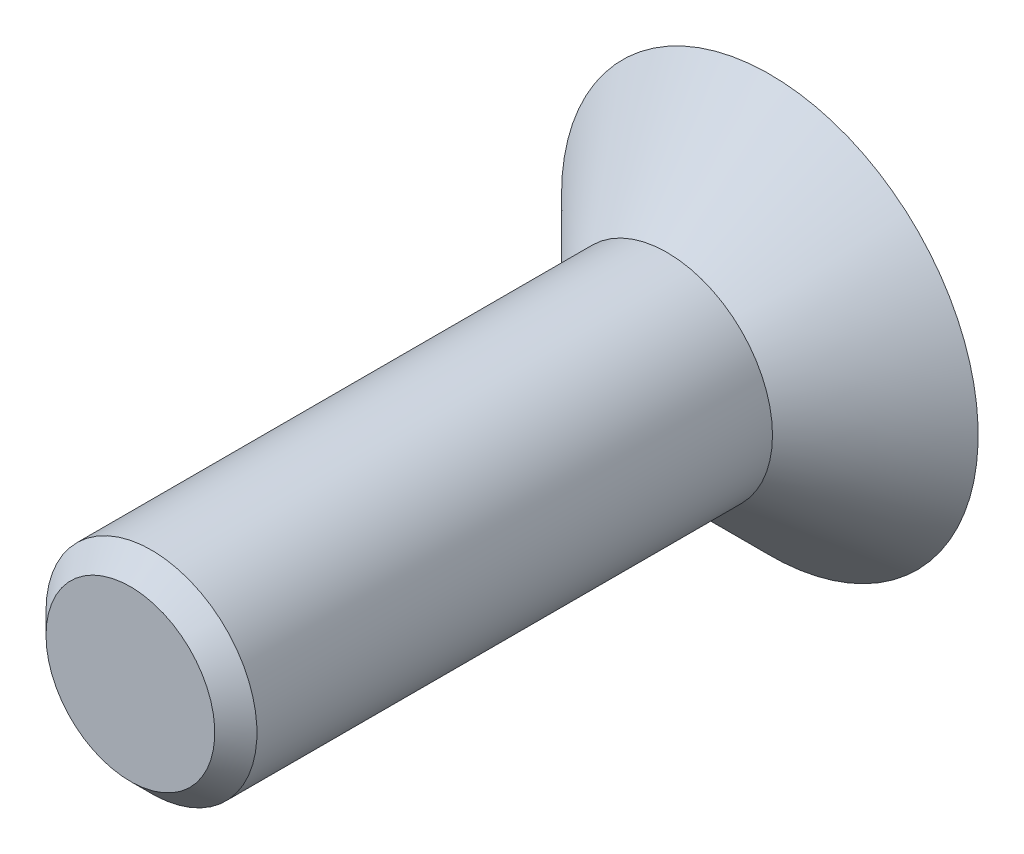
ISO-10303-21;
HEADER;
FILE_DESCRIPTION(('STEP AP214'),'2;1');
FILE_NAME('part.step','',(''),(''),'','','');
FILE_SCHEMA(('AUTOMOTIVE_DESIGN { 1 0 10303 214 1 1 1 1 }'));
ENDSEC;
DATA;
#1=APPLICATION_CONTEXT('core data for automotive mechanical design processes');
#2=APPLICATION_PROTOCOL_DEFINITION('international standard','automotive_design',2000,#1);
#3=PRODUCT_CONTEXT('',#1,'mechanical');
#4=PRODUCT('Part','Part','',(#3));
#5=PRODUCT_RELATED_PRODUCT_CATEGORY('part','',(#4));
#6=PRODUCT_DEFINITION_FORMATION('','',#4);
#7=PRODUCT_DEFINITION_CONTEXT('part definition',#1,'design');
#8=PRODUCT_DEFINITION('design','',#6,#7);
#9=PRODUCT_DEFINITION_SHAPE('','',#8);
#10=(LENGTH_UNIT() NAMED_UNIT(*) SI_UNIT(.MILLI.,.METRE.));
#11=(NAMED_UNIT(*) PLANE_ANGLE_UNIT() SI_UNIT($,.RADIAN.));
#12=(NAMED_UNIT(*) SI_UNIT($,.STERADIAN.) SOLID_ANGLE_UNIT());
#13=UNCERTAINTY_MEASURE_WITH_UNIT(LENGTH_MEASURE(1.E-05),#10,'distance_accuracy_value','');
#14=(GEOMETRIC_REPRESENTATION_CONTEXT(3) GLOBAL_UNCERTAINTY_ASSIGNED_CONTEXT((#13)) GLOBAL_UNIT_ASSIGNED_CONTEXT((#10,
#11,#12)) REPRESENTATION_CONTEXT('',''));
#15=CARTESIAN_POINT('',(0.,0.,0.));
#16=DIRECTION('',(0.,0.,1.));
#17=DIRECTION('',(1.,0.,0.));
#18=AXIS2_PLACEMENT_3D('',#15,#16,#17);
#19=CARTESIAN_POINT('',(0.,0.,-3.89999999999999));
#20=DIRECTION('',(0.,0.,1.));
#21=DIRECTION('',(1.,0.,0.));
#22=AXIS2_PLACEMENT_3D('',#19,#20,#21);
#23=PLANE('',#22);
#24=CARTESIAN_POINT('',(0.,0.,-3.89999999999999));
#25=DIRECTION('',(0.,0.,-1.));
#26=DIRECTION('',(-1.,0.,0.));
#27=AXIS2_PLACEMENT_3D('',#24,#25,#26);
#28=CIRCLE('',#27,7.9);
#29=CARTESIAN_POINT('',(-7.9,0.,-3.89999999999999));
#30=VERTEX_POINT('',#29);
#31=EDGE_CURVE('E96',#30,#30,#28,.T.);
#32=ORIENTED_EDGE('',*,*,#31,.T.);
#33=EDGE_LOOP('',(#32));
#34=FACE_BOUND('',#33,.T.);
#35=DIRECTION('',(-0.86602540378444,0.499999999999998,0.));
#36=VECTOR('',#35,1.);
#37=CARTESIAN_POINT('',(0.,2.88675134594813,-3.89999999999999));
#38=LINE('',#37,#36);
#39=CARTESIAN_POINT('',(2.5,1.44337567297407,-3.89999999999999));
#40=VERTEX_POINT('',#39);
#41=CARTESIAN_POINT('',(0.,2.88675134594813,-3.89999999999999));
#42=VERTEX_POINT('',#41);
#43=EDGE_CURVE('E42',#40,#42,#38,.T.);
#44=ORIENTED_EDGE('',*,*,#43,.T.);
#45=DIRECTION('',(-0.866025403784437,-0.500000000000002,0.));
#46=VECTOR('',#45,1.);
#47=CARTESIAN_POINT('',(-2.5,1.44337567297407,-3.89999999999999));
#48=LINE('',#47,#46);
#49=CARTESIAN_POINT('',(-2.5,1.44337567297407,-3.89999999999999));
#50=VERTEX_POINT('',#49);
#51=EDGE_CURVE('E82',#42,#50,#48,.T.);
#52=ORIENTED_EDGE('',*,*,#51,.T.);
#53=DIRECTION('',(0.,-1.,0.));
#54=VECTOR('',#53,1.);
#55=CARTESIAN_POINT('',(-2.5,-1.44337567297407,-3.89999999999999));
#56=LINE('',#55,#54);
#57=CARTESIAN_POINT('',(-2.5,-1.44337567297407,-3.89999999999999));
#58=VERTEX_POINT('',#57);
#59=EDGE_CURVE('E90',#50,#58,#56,.T.);
#60=ORIENTED_EDGE('',*,*,#59,.T.);
#61=DIRECTION('',(0.866025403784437,-0.500000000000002,0.));
#62=VECTOR('',#61,1.);
#63=CARTESIAN_POINT('',(-2.5,-1.44337567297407,-3.89999999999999));
#64=LINE('',#63,#62);
#65=CARTESIAN_POINT('',(0.,-2.88675134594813,-3.89999999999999));
#66=VERTEX_POINT('',#65);
#67=EDGE_CURVE('E108',#58,#66,#64,.T.);
#68=ORIENTED_EDGE('',*,*,#67,.T.);
#69=DIRECTION('',(0.86602540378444,0.499999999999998,0.));
#70=VECTOR('',#69,1.);
#71=CARTESIAN_POINT('',(0.,-2.88675134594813,-3.89999999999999));
#72=LINE('',#71,#70);
#73=CARTESIAN_POINT('',(2.5,-1.44337567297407,-3.89999999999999));
#74=VERTEX_POINT('',#73);
#75=EDGE_CURVE('E111',#66,#74,#72,.T.);
#76=ORIENTED_EDGE('',*,*,#75,.T.);
#77=DIRECTION('',(0.,1.,0.));
#78=VECTOR('',#77,1.);
#79=CARTESIAN_POINT('',(2.5,-1.44337567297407,-3.89999999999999));
#80=LINE('',#79,#78);
#81=EDGE_CURVE('E101',#74,#40,#80,.T.);
#82=ORIENTED_EDGE('',*,*,#81,.T.);
#83=EDGE_LOOP('',(#44,#52,#60,#68,#76,#82));
#84=FACE_BOUND('',#83,.T.);
#85=ADVANCED_FACE('F28',(#34,#84),#23,.F.);
#86=CARTESIAN_POINT('',(0.,0.,0.));
#87=DIRECTION('',(0.,0.,-1.));
#88=DIRECTION('',(-1.,0.,0.));
#89=AXIS2_PLACEMENT_3D('',#86,#87,#88);
#90=CONICAL_SURFACE('',#89,4.,0.78539816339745);
#91=ORIENTED_EDGE('',*,*,#31,.F.);
#92=EDGE_LOOP('',(#91));
#93=FACE_BOUND('',#92,.T.);
#94=CARTESIAN_POINT('',(0.,0.,0.));
#95=DIRECTION('',(0.,0.,1.));
#96=DIRECTION('',(1.,0.,0.));
#97=AXIS2_PLACEMENT_3D('',#94,#95,#96);
#98=CIRCLE('',#97,4.);
#99=CARTESIAN_POINT('',(4.,0.,0.));
#100=VERTEX_POINT('',#99);
#101=EDGE_CURVE('E102',#100,#100,#98,.T.);
#102=ORIENTED_EDGE('',*,*,#101,.F.);
#103=EDGE_LOOP('',(#102));
#104=FACE_BOUND('',#103,.T.);
#105=ADVANCED_FACE('F151',(#93,#104),#90,.T.);
#106=CARTESIAN_POINT('',(0.,2.88675134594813,-0.0999999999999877));
#107=DIRECTION('',(-0.499999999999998,-0.86602540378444,0.));
#108=DIRECTION('',(0.86602540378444,-0.499999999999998,0.));
#109=AXIS2_PLACEMENT_3D('',#106,#107,#108);
#110=PLANE('',#109);
#111=ORIENTED_EDGE('',*,*,#43,.F.);
#112=DIRECTION('',(0.,0.,-1.));
#113=VECTOR('',#112,1.);
#114=CARTESIAN_POINT('',(2.5,1.44337567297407,-0.0999999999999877));
#115=LINE('',#114,#113);
#116=CARTESIAN_POINT('',(2.5,1.44337567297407,-0.0999999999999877));
#117=VERTEX_POINT('',#116);
#118=EDGE_CURVE('E124',#117,#40,#115,.T.);
#119=ORIENTED_EDGE('',*,*,#118,.F.);
#120=DIRECTION('',(-0.86602540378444,0.499999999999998,0.));
#121=VECTOR('',#120,1.);
#122=CARTESIAN_POINT('',(0.,2.88675134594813,-0.0999999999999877));
#123=LINE('',#122,#121);
#124=CARTESIAN_POINT('',(0.,2.88675134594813,-0.0999999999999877));
#125=VERTEX_POINT('',#124);
#126=EDGE_CURVE('E95',#117,#125,#123,.T.);
#127=ORIENTED_EDGE('',*,*,#126,.T.);
#128=DIRECTION('',(0.,0.,-1.));
#129=VECTOR('',#128,1.);
#130=CARTESIAN_POINT('',(0.,2.88675134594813,-0.0999999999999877));
#131=LINE('',#130,#129);
#132=EDGE_CURVE('E84',#125,#42,#131,.T.);
#133=ORIENTED_EDGE('',*,*,#132,.T.);
#134=EDGE_LOOP('',(#111,#119,#127,#133));
#135=FACE_BOUND('',#134,.T.);
#136=ADVANCED_FACE('F93',(#135),#110,.T.);
#137=CARTESIAN_POINT('',(-2.5,1.44337567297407,-0.0999999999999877));
#138=DIRECTION('',(0.500000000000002,-0.866025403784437,0.));
#139=DIRECTION('',(0.866025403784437,0.500000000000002,0.));
#140=AXIS2_PLACEMENT_3D('',#137,#138,#139);
#141=PLANE('',#140);
#142=ORIENTED_EDGE('',*,*,#51,.F.);
#143=ORIENTED_EDGE('',*,*,#132,.F.);
#144=DIRECTION('',(-0.866025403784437,-0.500000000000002,0.));
#145=VECTOR('',#144,1.);
#146=CARTESIAN_POINT('',(-2.5,1.44337567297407,-0.0999999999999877));
#147=LINE('',#146,#145);
#148=CARTESIAN_POINT('',(-2.5,1.44337567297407,-0.0999999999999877));
#149=VERTEX_POINT('',#148);
#150=EDGE_CURVE('E115',#125,#149,#147,.T.);
#151=ORIENTED_EDGE('',*,*,#150,.T.);
#152=DIRECTION('',(0.,0.,-1.));
#153=VECTOR('',#152,1.);
#154=CARTESIAN_POINT('',(-2.5,1.44337567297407,-0.0999999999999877));
#155=LINE('',#154,#153);
#156=EDGE_CURVE('E86',#149,#50,#155,.T.);
#157=ORIENTED_EDGE('',*,*,#156,.T.);
#158=EDGE_LOOP('',(#142,#143,#151,#157));
#159=FACE_BOUND('',#158,.T.);
#160=ADVANCED_FACE('F83',(#159),#141,.T.);
#161=CARTESIAN_POINT('',(-2.5,-1.44337567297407,-0.0999999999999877));
#162=DIRECTION('',(1.,0.,0.));
#163=DIRECTION('',(0.,0.,-1.));
#164=AXIS2_PLACEMENT_3D('',#161,#162,#163);
#165=PLANE('',#164);
#166=ORIENTED_EDGE('',*,*,#59,.F.);
#167=ORIENTED_EDGE('',*,*,#156,.F.);
#168=DIRECTION('',(0.,-1.,0.));
#169=VECTOR('',#168,1.);
#170=CARTESIAN_POINT('',(-2.5,-1.44337567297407,-0.0999999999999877));
#171=LINE('',#170,#169);
#172=CARTESIAN_POINT('',(-2.5,-1.44337567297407,-0.0999999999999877));
#173=VERTEX_POINT('',#172);
#174=EDGE_CURVE('E117',#149,#173,#171,.T.);
#175=ORIENTED_EDGE('',*,*,#174,.T.);
#176=DIRECTION('',(0.,0.,-1.));
#177=VECTOR('',#176,1.);
#178=CARTESIAN_POINT('',(-2.5,-1.44337567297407,-0.0999999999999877));
#179=LINE('',#178,#177);
#180=EDGE_CURVE('E130',#173,#58,#179,.T.);
#181=ORIENTED_EDGE('',*,*,#180,.T.);
#182=EDGE_LOOP('',(#166,#167,#175,#181));
#183=FACE_BOUND('',#182,.T.);
#184=ADVANCED_FACE('F168',(#183),#165,.T.);
#185=CARTESIAN_POINT('',(-2.5,-1.44337567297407,-0.0999999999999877));
#186=DIRECTION('',(0.500000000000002,0.866025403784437,0.));
#187=DIRECTION('',(-0.866025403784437,0.500000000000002,0.));
#188=AXIS2_PLACEMENT_3D('',#185,#186,#187);
#189=PLANE('',#188);
#190=ORIENTED_EDGE('',*,*,#67,.F.);
#191=ORIENTED_EDGE('',*,*,#180,.F.);
#192=DIRECTION('',(0.866025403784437,-0.500000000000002,0.));
#193=VECTOR('',#192,1.);
#194=CARTESIAN_POINT('',(-2.5,-1.44337567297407,-0.0999999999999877));
#195=LINE('',#194,#193);
#196=CARTESIAN_POINT('',(0.,-2.88675134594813,-0.0999999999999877));
#197=VERTEX_POINT('',#196);
#198=EDGE_CURVE('E119',#173,#197,#195,.T.);
#199=ORIENTED_EDGE('',*,*,#198,.T.);
#200=DIRECTION('',(0.,0.,-1.));
#201=VECTOR('',#200,1.);
#202=CARTESIAN_POINT('',(0.,-2.88675134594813,-0.0999999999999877));
#203=LINE('',#202,#201);
#204=EDGE_CURVE('E128',#197,#66,#203,.T.);
#205=ORIENTED_EDGE('',*,*,#204,.T.);
#206=EDGE_LOOP('',(#190,#191,#199,#205));
#207=FACE_BOUND('',#206,.T.);
#208=ADVANCED_FACE('F171',(#207),#189,.T.);
#209=CARTESIAN_POINT('',(0.,-2.88675134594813,-0.0999999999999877));
#210=DIRECTION('',(-0.499999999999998,0.86602540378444,0.));
#211=DIRECTION('',(-0.86602540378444,-0.499999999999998,0.));
#212=AXIS2_PLACEMENT_3D('',#209,#210,#211);
#213=PLANE('',#212);
#214=ORIENTED_EDGE('',*,*,#75,.F.);
#215=ORIENTED_EDGE('',*,*,#204,.F.);
#216=DIRECTION('',(0.86602540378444,0.499999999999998,0.));
#217=VECTOR('',#216,1.);
#218=CARTESIAN_POINT('',(0.,-2.88675134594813,-0.0999999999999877));
#219=LINE('',#218,#217);
#220=CARTESIAN_POINT('',(2.5,-1.44337567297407,-0.0999999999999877));
#221=VERTEX_POINT('',#220);
#222=EDGE_CURVE('E121',#197,#221,#219,.T.);
#223=ORIENTED_EDGE('',*,*,#222,.T.);
#224=DIRECTION('',(0.,0.,-1.));
#225=VECTOR('',#224,1.);
#226=CARTESIAN_POINT('',(2.5,-1.44337567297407,-0.0999999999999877));
#227=LINE('',#226,#225);
#228=EDGE_CURVE('E126',#221,#74,#227,.T.);
#229=ORIENTED_EDGE('',*,*,#228,.T.);
#230=EDGE_LOOP('',(#214,#215,#223,#229));
#231=FACE_BOUND('',#230,.T.);
#232=ADVANCED_FACE('F175',(#231),#213,.T.);
#233=CARTESIAN_POINT('',(2.5,-1.44337567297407,-0.0999999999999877));
#234=DIRECTION('',(-1.,0.,0.));
#235=DIRECTION('',(0.,0.,1.));
#236=AXIS2_PLACEMENT_3D('',#233,#234,#235);
#237=PLANE('',#236);
#238=ORIENTED_EDGE('',*,*,#81,.F.);
#239=ORIENTED_EDGE('',*,*,#228,.F.);
#240=DIRECTION('',(0.,1.,0.));
#241=VECTOR('',#240,1.);
#242=CARTESIAN_POINT('',(2.5,-1.44337567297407,-0.0999999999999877));
#243=LINE('',#242,#241);
#244=EDGE_CURVE('E49',#221,#117,#243,.T.);
#245=ORIENTED_EDGE('',*,*,#244,.T.);
#246=ORIENTED_EDGE('',*,*,#118,.T.);
#247=EDGE_LOOP('',(#238,#239,#245,#246));
#248=FACE_BOUND('',#247,.T.);
#249=ADVANCED_FACE('F179',(#248),#237,.T.);
#250=CARTESIAN_POINT('',(2.5,1.44337567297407,-0.0999999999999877));
#251=DIRECTION('',(0.,0.,1.));
#252=DIRECTION('',(1.,0.,0.));
#253=AXIS2_PLACEMENT_3D('',#250,#251,#252);
#254=PLANE('',#253);
#255=ORIENTED_EDGE('',*,*,#126,.F.);
#256=ORIENTED_EDGE('',*,*,#244,.F.);
#257=ORIENTED_EDGE('',*,*,#222,.F.);
#258=ORIENTED_EDGE('',*,*,#198,.F.);
#259=ORIENTED_EDGE('',*,*,#174,.F.);
#260=ORIENTED_EDGE('',*,*,#150,.F.);
#261=EDGE_LOOP('',(#255,#256,#257,#258,#259,#260));
#262=FACE_BOUND('',#261,.T.);
#263=ADVANCED_FACE('F183',(#262),#254,.F.);
#264=CARTESIAN_POINT('',(0.,0.,20.35));
#265=DIRECTION('',(0.,0.,1.));
#266=DIRECTION('',(1.,0.,0.));
#267=AXIS2_PLACEMENT_3D('',#264,#265,#266);
#268=PLANE('',#267);
#269=CARTESIAN_POINT('',(0.,0.,20.35));
#270=DIRECTION('',(0.,0.,1.));
#271=DIRECTION('',(1.,0.,0.));
#272=AXIS2_PLACEMENT_3D('',#269,#270,#271);
#273=CIRCLE('',#272,3.20000000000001);
#274=CARTESIAN_POINT('',(-3.2,0.,20.35));
#275=VERTEX_POINT('',#274);
#276=EDGE_CURVE('E35',#275,#275,#273,.T.);
#277=ORIENTED_EDGE('',*,*,#276,.T.);
#278=EDGE_LOOP('',(#277));
#279=FACE_BOUND('',#278,.T.);
#280=ADVANCED_FACE('F137',(#279),#268,.T.);
#281=CARTESIAN_POINT('',(0.,0.,0.));
#282=DIRECTION('',(0.,0.,1.));
#283=DIRECTION('',(1.,0.,0.));
#284=AXIS2_PLACEMENT_3D('',#281,#282,#283);
#285=CYLINDRICAL_SURFACE('',#284,4.);
#286=CARTESIAN_POINT('',(0.,0.,19.55));
#287=DIRECTION('',(0.,0.,1.));
#288=DIRECTION('',(1.,0.,0.));
#289=AXIS2_PLACEMENT_3D('',#286,#287,#288);
#290=CIRCLE('',#289,4.);
#291=CARTESIAN_POINT('',(-4.,0.,19.55));
#292=VERTEX_POINT('',#291);
#293=EDGE_CURVE('E11',#292,#292,#290,.F.);
#294=ORIENTED_EDGE('',*,*,#293,.T.);
#295=EDGE_LOOP('',(#294));
#296=FACE_BOUND('',#295,.T.);
#297=ORIENTED_EDGE('',*,*,#101,.T.);
#298=EDGE_LOOP('',(#297));
#299=FACE_BOUND('',#298,.T.);
#300=ADVANCED_FACE('F141',(#296,#299),#285,.T.);
#301=CARTESIAN_POINT('',(0.,0.,20.35));
#302=DIRECTION('',(0.,0.,-1.));
#303=DIRECTION('',(-1.,0.,0.));
#304=AXIS2_PLACEMENT_3D('',#301,#302,#303);
#305=CONICAL_SURFACE('',#304,3.20000000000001,0.785398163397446);
#306=CARTESIAN_POINT('',(-4.,0.,19.55));
#307=CARTESIAN_POINT('',(-3.99166666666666,0.,19.5583333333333));
#308=CARTESIAN_POINT('',(-3.98333333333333,0.,19.5666666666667));
#309=CARTESIAN_POINT('',(-3.96666666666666,0.,19.5833333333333));
#310=CARTESIAN_POINT('',(-3.95833333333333,0.,19.5916666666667));
#311=CARTESIAN_POINT('',(-3.94166666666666,0.,19.6083333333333));
#312=CARTESIAN_POINT('',(-3.93333333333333,0.,19.6166666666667));
#313=CARTESIAN_POINT('',(-3.91666666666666,0.,19.6333333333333));
#314=CARTESIAN_POINT('',(-3.90833333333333,0.,19.6416666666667));
#315=CARTESIAN_POINT('',(-3.89166666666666,0.,19.6583333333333));
#316=CARTESIAN_POINT('',(-3.88333333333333,0.,19.6666666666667));
#317=CARTESIAN_POINT('',(-3.86666666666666,0.,19.6833333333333));
#318=CARTESIAN_POINT('',(-3.85833333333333,0.,19.6916666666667));
#319=CARTESIAN_POINT('',(-3.84166666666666,0.,19.7083333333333));
#320=CARTESIAN_POINT('',(-3.83333333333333,0.,19.7166666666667));
#321=CARTESIAN_POINT('',(-3.81666666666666,0.,19.7333333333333));
#322=CARTESIAN_POINT('',(-3.80833333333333,0.,19.7416666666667));
#323=CARTESIAN_POINT('',(-3.79166666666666,0.,19.7583333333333));
#324=CARTESIAN_POINT('',(-3.78333333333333,0.,19.7666666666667));
#325=CARTESIAN_POINT('',(-3.76666666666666,0.,19.7833333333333));
#326=CARTESIAN_POINT('',(-3.75833333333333,0.,19.7916666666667));
#327=CARTESIAN_POINT('',(-3.74166666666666,0.,19.8083333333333));
#328=CARTESIAN_POINT('',(-3.73333333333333,0.,19.8166666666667));
#329=CARTESIAN_POINT('',(-3.71666666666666,0.,19.8333333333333));
#330=CARTESIAN_POINT('',(-3.70833333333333,0.,19.8416666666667));
#331=CARTESIAN_POINT('',(-3.69166666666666,0.,19.8583333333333));
#332=CARTESIAN_POINT('',(-3.68333333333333,0.,19.8666666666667));
#333=CARTESIAN_POINT('',(-3.66666666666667,0.,19.8833333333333));
#334=CARTESIAN_POINT('',(-3.65833333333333,0.,19.8916666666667));
#335=CARTESIAN_POINT('',(-3.64166666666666,0.,19.9083333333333));
#336=CARTESIAN_POINT('',(-3.63333333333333,0.,19.9166666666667));
#337=CARTESIAN_POINT('',(-3.61666666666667,0.,19.9333333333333));
#338=CARTESIAN_POINT('',(-3.60833333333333,0.,19.9416666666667));
#339=CARTESIAN_POINT('',(-3.59166666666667,0.,19.9583333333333));
#340=CARTESIAN_POINT('',(-3.58333333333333,0.,19.9666666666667));
#341=CARTESIAN_POINT('',(-3.56666666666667,0.,19.9833333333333));
#342=CARTESIAN_POINT('',(-3.55833333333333,0.,19.9916666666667));
#343=CARTESIAN_POINT('',(-3.54166666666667,0.,20.0083333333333));
#344=CARTESIAN_POINT('',(-3.53333333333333,0.,20.0166666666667));
#345=CARTESIAN_POINT('',(-3.51666666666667,0.,20.0333333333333));
#346=CARTESIAN_POINT('',(-3.50833333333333,0.,20.0416666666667));
#347=CARTESIAN_POINT('',(-3.49166666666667,0.,20.0583333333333));
#348=CARTESIAN_POINT('',(-3.48333333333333,0.,20.0666666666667));
#349=CARTESIAN_POINT('',(-3.46666666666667,0.,20.0833333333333));
#350=CARTESIAN_POINT('',(-3.45833333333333,0.,20.0916666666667));
#351=CARTESIAN_POINT('',(-3.44166666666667,0.,20.1083333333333));
#352=CARTESIAN_POINT('',(-3.43333333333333,0.,20.1166666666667));
#353=CARTESIAN_POINT('',(-3.41666666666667,0.,20.1333333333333));
#354=CARTESIAN_POINT('',(-3.40833333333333,0.,20.1416666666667));
#355=CARTESIAN_POINT('',(-3.39166666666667,0.,20.1583333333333));
#356=CARTESIAN_POINT('',(-3.38333333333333,0.,20.1666666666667));
#357=CARTESIAN_POINT('',(-3.36666666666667,0.,20.1833333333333));
#358=CARTESIAN_POINT('',(-3.35833333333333,0.,20.1916666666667));
#359=CARTESIAN_POINT('',(-3.34166666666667,0.,20.2083333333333));
#360=CARTESIAN_POINT('',(-3.33333333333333,0.,20.2166666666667));
#361=CARTESIAN_POINT('',(-3.31666666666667,0.,20.2333333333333));
#362=CARTESIAN_POINT('',(-3.30833333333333,0.,20.2416666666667));
#363=CARTESIAN_POINT('',(-3.29166666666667,0.,20.2583333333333));
#364=CARTESIAN_POINT('',(-3.28333333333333,0.,20.2666666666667));
#365=CARTESIAN_POINT('',(-3.26666666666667,0.,20.2833333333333));
#366=CARTESIAN_POINT('',(-3.25833333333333,0.,20.2916666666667));
#367=CARTESIAN_POINT('',(-3.24166666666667,0.,20.3083333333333));
#368=CARTESIAN_POINT('',(-3.23333333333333,0.,20.3166666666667));
#369=CARTESIAN_POINT('',(-3.21666666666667,0.,20.3333333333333));
#370=CARTESIAN_POINT('',(-3.20833333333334,0.,20.3416666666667));
#371=CARTESIAN_POINT('',(-3.2,0.,20.35));
#372=B_SPLINE_CURVE_WITH_KNOTS('',3,(#306,#307,#308,#309,#310,#311,#312,#313,#314,#315,#316,
#317,#318,#319,#320,#321,#322,#323,#324,#325,#326,#327,#328,#329,#330,#331,#332,#333,#334,#335,
#336,#337,#338,#339,#340,#341,#342,#343,#344,#345,#346,#347,#348,#349,#350,#351,#352,#353,#354,
#355,#356,#357,#358,#359,#360,#361,#362,#363,#364,#365,#366,#367,#368,#369,#370,#371),
.UNSPECIFIED.,.F.,.F.,(4,2,2,2,2,2,2,2,2,2,2,2,2,2,2,2,2,2,2,2,2,2,2,2,2,2,2,2,2,2,2,2,4),(0.,
0.0353553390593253,0.0707106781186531,0.106066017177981,0.141421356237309,0.176776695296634,
0.212132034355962,0.24748737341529,0.282842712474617,0.318198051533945,0.35355339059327,
0.388908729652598,0.424264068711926,0.459619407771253,0.494974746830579,0.530330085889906,
0.565685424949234,0.601040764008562,0.63639610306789,0.671751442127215,0.707106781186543,
0.742462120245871,0.777817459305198,0.813172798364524,0.848528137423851,0.883883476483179,
0.919238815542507,0.954594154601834,0.98994949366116,1.02530483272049,1.06066017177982,
1.09601551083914,1.13137084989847),.UNSPECIFIED.);
#373=EDGE_CURVE('BSEAM139',#292,#275,#372,.T.);
#374=ORIENTED_EDGE('',*,*,#293,.F.);
#375=ORIENTED_EDGE('',*,*,#276,.F.);
#376=ORIENTED_EDGE('',*,*,#373,.T.);
#377=ORIENTED_EDGE('',*,*,#373,.F.);
#378=EDGE_LOOP('',(#374,#376,#375,#377));
#379=FACE_BOUND('',#378,.T.);
#380=ADVANCED_FACE('F139',(#379),#305,.T.);
#381=CLOSED_SHELL('',(#85,#105,#136,#160,#184,#208,#232,#249,#263,#280,#300,#380));
#382=MANIFOLD_SOLID_BREP('B2',#381);
#383=ADVANCED_BREP_SHAPE_REPRESENTATION('',(#18,#382),#14);
#384=SHAPE_DEFINITION_REPRESENTATION(#9,#383);
ENDSEC;
END-ISO-10303-21;
